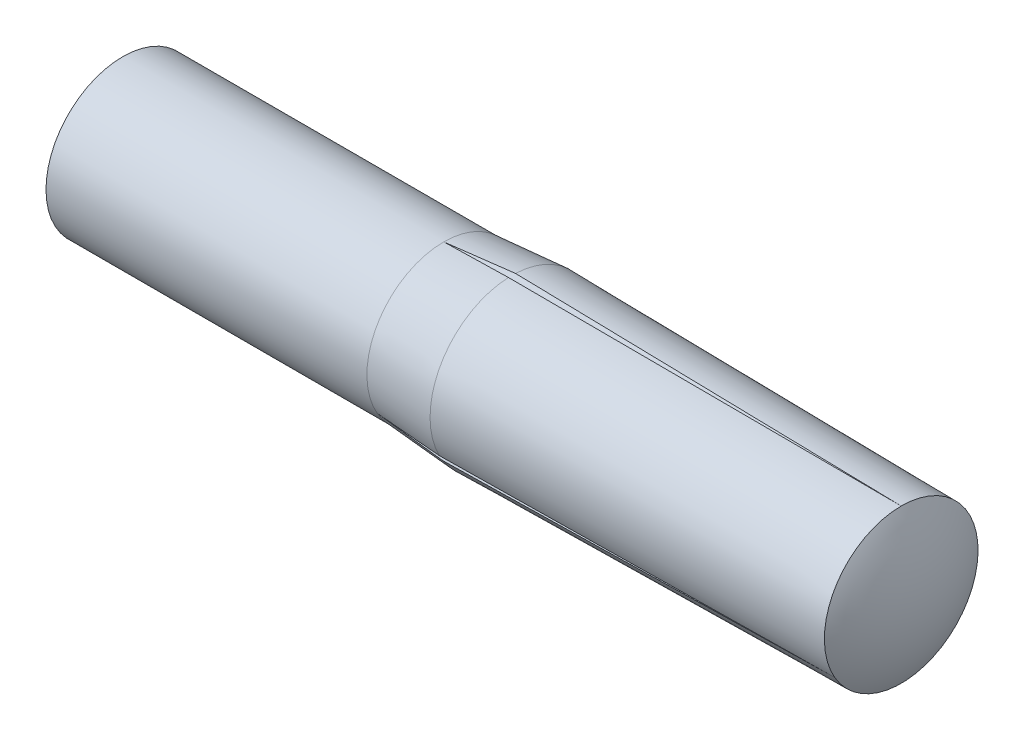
from build123d import *

# Parameters (mm, degrees)
CUT_EXTRUDE2_DEPTH = 9.079603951
CIRPATTERN2_COUNT  = 3


with BuildPart() as part:
    # Sketch1 → Revolve2 (revolve)
    with BuildSketch(Plane.XY, mode=Mode.PRIVATE) as revolve2_sk:
        with BuildLine():
            Line((0.2, 0.75), (3.333333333, 0.75))
            Line((3.333333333, 0.75), (4, 0.8))
            Line((4, 0.8), (7.8, 0.75))
            ThreePointArc((7.8, 0.75), (7.949141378, 0.388104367), (8, 0))
            Line((8, 0), (0, 0))
            ThreePointArc((0, 0), (0.050858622, 0.388104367), (0.2, 0.75))
        make_face()
    revolve(revolve2_sk.sketch.rotate(Axis((0, 0, 0), (1, 0, 0)), 90), axis=Axis((0, 0, 0), (1, 0, 0)))

    # Sketch2 → Cut-Extrude2 (cut, through all)
    with BuildSketch(Plane(origin=(0, 0, 0), x_dir=(0, 0, -1), z_dir=(1, 0, 0))):
        Polygon((0, 0.75), (-0.070020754, 0.85), (0.070020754, 0.85), align=None)
    cut_extrude2 = extrude(amount=CUT_EXTRUDE2_DEPTH, mode=Mode.SUBTRACT)

    # CirPattern2: Cut-Extrude2 ×3 about axis
    cirpattern2_axis = Axis((0, 0, 0), (1, 0, 0))
    for i in range(1, CIRPATTERN2_COUNT):
        add(cut_extrude2.rotate(cirpattern2_axis, i * 360 / CIRPATTERN2_COUNT), mode=Mode.SUBTRACT)


solid = part.part
